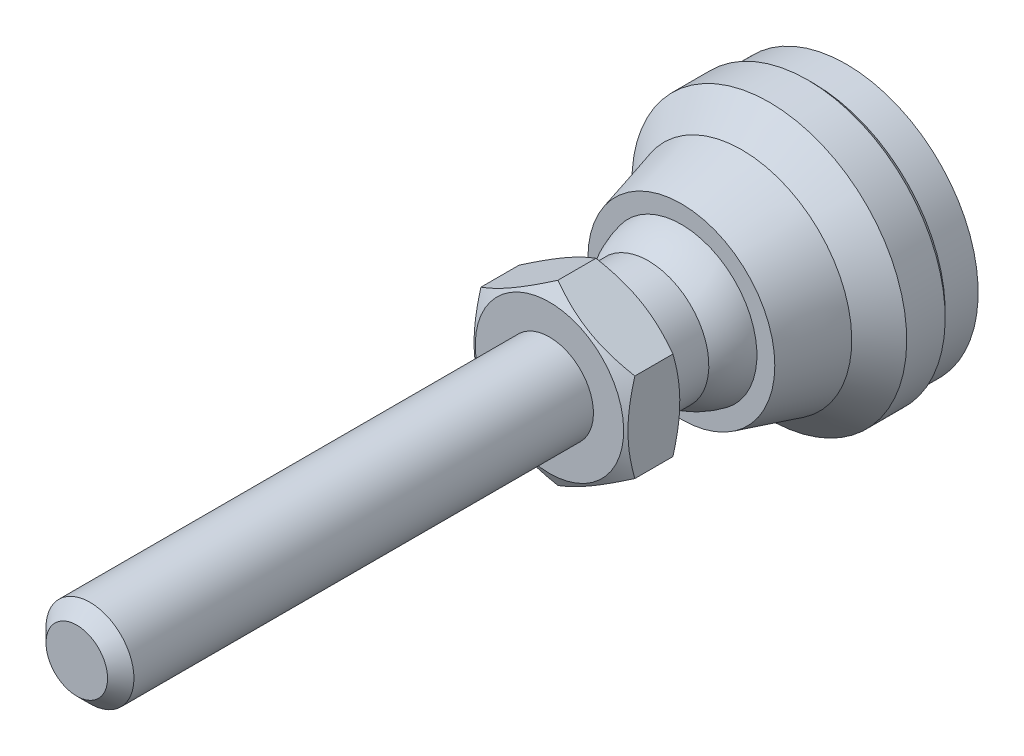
ISO-10303-21;
HEADER;
FILE_DESCRIPTION(('STEP AP214'),'2;1');
FILE_NAME('part.step','',(''),(''),'','','');
FILE_SCHEMA(('AUTOMOTIVE_DESIGN { 1 0 10303 214 1 1 1 1 }'));
ENDSEC;
DATA;
#1=APPLICATION_CONTEXT('core data for automotive mechanical design processes');
#2=APPLICATION_PROTOCOL_DEFINITION('international standard','automotive_design',2000,#1);
#3=PRODUCT_CONTEXT('',#1,'mechanical');
#4=PRODUCT('Part','Part','',(#3));
#5=PRODUCT_RELATED_PRODUCT_CATEGORY('part','',(#4));
#6=PRODUCT_DEFINITION_FORMATION('','',#4);
#7=PRODUCT_DEFINITION_CONTEXT('part definition',#1,'design');
#8=PRODUCT_DEFINITION('design','',#6,#7);
#9=PRODUCT_DEFINITION_SHAPE('','',#8);
#10=(LENGTH_UNIT() NAMED_UNIT(*) SI_UNIT(.MILLI.,.METRE.));
#11=(NAMED_UNIT(*) PLANE_ANGLE_UNIT() SI_UNIT($,.RADIAN.));
#12=(NAMED_UNIT(*) SI_UNIT($,.STERADIAN.) SOLID_ANGLE_UNIT());
#13=UNCERTAINTY_MEASURE_WITH_UNIT(LENGTH_MEASURE(1.E-05),#10,'distance_accuracy_value','');
#14=(GEOMETRIC_REPRESENTATION_CONTEXT(3) GLOBAL_UNCERTAINTY_ASSIGNED_CONTEXT((#13)) GLOBAL_UNIT_ASSIGNED_CONTEXT((#10,
#11,#12)) REPRESENTATION_CONTEXT('',''));
#15=CARTESIAN_POINT('',(0.,0.,0.));
#16=DIRECTION('',(0.,0.,1.));
#17=DIRECTION('',(1.,0.,0.));
#18=AXIS2_PLACEMENT_3D('',#15,#16,#17);
#19=CARTESIAN_POINT('',(-12.,0.,0.));
#20=DIRECTION('',(0.,0.,1.));
#21=DIRECTION('',(0.,-1.,0.));
#22=AXIS2_PLACEMENT_3D('',#19,#20,#21);
#23=PLANE('',#22);
#24=CARTESIAN_POINT('',(0.,0.,0.));
#25=DIRECTION('',(0.,0.,-1.));
#26=DIRECTION('',(0.,1.,0.));
#27=AXIS2_PLACEMENT_3D('',#24,#25,#26);
#28=CIRCLE('',#27,12.);
#29=CARTESIAN_POINT('',(0.,12.,0.));
#30=VERTEX_POINT('',#29);
#31=EDGE_CURVE('E95',#30,#30,#28,.T.);
#32=ORIENTED_EDGE('',*,*,#31,.T.);
#33=EDGE_LOOP('',(#32));
#34=FACE_BOUND('',#33,.T.);
#35=ADVANCED_FACE('F14',(#34),#23,.F.);
#36=CARTESIAN_POINT('',(-5.49999999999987,0.,22.));
#37=DIRECTION('',(0.,0.,1.));
#38=DIRECTION('',(0.,-1.,0.));
#39=AXIS2_PLACEMENT_3D('',#36,#37,#38);
#40=PLANE('',#39);
#41=CARTESIAN_POINT('',(0.,0.,22.));
#42=DIRECTION('',(0.,0.,1.));
#43=DIRECTION('',(0.,-1.,0.));
#44=AXIS2_PLACEMENT_3D('',#41,#42,#43);
#45=CIRCLE('',#44,6.75);
#46=CARTESIAN_POINT('',(0.,-6.75,22.));
#47=VERTEX_POINT('',#46);
#48=EDGE_CURVE('E454',#47,#47,#45,.T.);
#49=ORIENTED_EDGE('',*,*,#48,.F.);
#50=EDGE_LOOP('',(#49));
#51=FACE_BOUND('',#50,.T.);
#52=CARTESIAN_POINT('',(0.,0.,22.));
#53=DIRECTION('',(0.,0.,-1.));
#54=DIRECTION('',(0.,1.,0.));
#55=AXIS2_PLACEMENT_3D('',#52,#53,#54);
#56=CIRCLE('',#55,5.49999999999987);
#57=CARTESIAN_POINT('',(0.,5.49999999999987,22.));
#58=VERTEX_POINT('',#57);
#59=EDGE_CURVE('E119',#58,#58,#56,.T.);
#60=ORIENTED_EDGE('',*,*,#59,.F.);
#61=EDGE_LOOP('',(#60));
#62=FACE_BOUND('',#61,.T.);
#63=ADVANCED_FACE('F145',(#51,#62),#40,.F.);
#64=CARTESIAN_POINT('',(0.,0.,0.));
#65=DIRECTION('',(0.,0.,-1.));
#66=DIRECTION('',(0.,1.,0.));
#67=AXIS2_PLACEMENT_3D('',#64,#65,#66);
#68=CYLINDRICAL_SURFACE('',#67,5.49999999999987);
#69=CARTESIAN_POINT('',(0.,0.,18.));
#70=DIRECTION('',(0.,0.,-1.));
#71=DIRECTION('',(0.,1.,0.));
#72=AXIS2_PLACEMENT_3D('',#69,#70,#71);
#73=CIRCLE('',#72,5.49999999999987);
#74=CARTESIAN_POINT('',(-5.49999999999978,0.,18.));
#75=VERTEX_POINT('',#74);
#76=EDGE_CURVE('E116',#75,#75,#73,.T.);
#77=ORIENTED_EDGE('',*,*,#76,.F.);
#78=EDGE_LOOP('',(#77));
#79=FACE_BOUND('',#78,.T.);
#80=ORIENTED_EDGE('',*,*,#59,.T.);
#81=EDGE_LOOP('',(#80));
#82=FACE_BOUND('',#81,.T.);
#83=ADVANCED_FACE('F151',(#79,#82),#68,.T.);
#84=CARTESIAN_POINT('',(1.38777878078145E-13,0.,13.6698729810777));
#85=DIRECTION('',(0.,0.,-1.));
#86=DIRECTION('',(-1.,0.,0.));
#87=AXIS2_PLACEMENT_3D('',#84,#85,#86);
#88=SPHERICAL_SURFACE('',#87,7.);
#89=CARTESIAN_POINT('',(0.,0.,15.));
#90=DIRECTION('',(0.,0.,-1.));
#91=DIRECTION('',(0.,1.,0.));
#92=AXIS2_PLACEMENT_3D('',#89,#90,#91);
#93=CIRCLE('',#92,6.87246404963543);
#94=CARTESIAN_POINT('',(-6.8724640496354,0.,15.));
#95=VERTEX_POINT('',#94);
#96=EDGE_CURVE('E113',#95,#95,#93,.T.);
#97=CARTESIAN_POINT('',(-6.8724640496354,0.,15.));
#98=CARTESIAN_POINT('',(-6.86587210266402,0.,15.0340591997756));
#99=CARTESIAN_POINT('',(-6.85902692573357,0.,15.0680693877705));
#100=CARTESIAN_POINT('',(-6.84483171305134,0.,15.1359842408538));
#101=CARTESIAN_POINT('',(-6.83748167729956,0.,15.1698889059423));
#102=CARTESIAN_POINT('',(-6.82227834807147,0.,15.2375852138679));
#103=CARTESIAN_POINT('',(-6.81442505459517,0.,15.2713768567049));
#104=CARTESIAN_POINT('',(-6.79821695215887,0.,15.3388396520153));
#105=CARTESIAN_POINT('',(-6.78986214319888,0.,15.3725108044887));
#106=CARTESIAN_POINT('',(-6.77265285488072,0.,15.4397251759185));
#107=CARTESIAN_POINT('',(-6.76379837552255,0.,15.473268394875));
#108=CARTESIAN_POINT('',(-6.74559170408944,0.,15.5402194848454));
#109=CARTESIAN_POINT('',(-6.7362395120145,0.,15.5736273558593));
#110=CARTESIAN_POINT('',(-6.71703948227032,0.,15.6403003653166));
#111=CARTESIAN_POINT('',(-6.70719164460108,0.,15.67356550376));
#112=CARTESIAN_POINT('',(-6.68700250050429,0.,15.7399456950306));
#113=CARTESIAN_POINT('',(-6.67666119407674,0.,15.7730607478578));
#114=CARTESIAN_POINT('',(-6.65548739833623,0.,15.8391334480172));
#115=CARTESIAN_POINT('',(-6.64465490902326,0.,15.8720910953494));
#116=CARTESIAN_POINT('',(-6.62250114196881,0.,15.9378416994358));
#117=CARTESIAN_POINT('',(-6.61117986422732,0.,15.9706346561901));
#118=CARTESIAN_POINT('',(-6.5880510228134,0.,16.0360486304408));
#119=CARTESIAN_POINT('',(-6.57624345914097,0.,16.0686696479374));
#120=CARTESIAN_POINT('',(-6.55214465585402,0.,16.1337325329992));
#121=CARTESIAN_POINT('',(-6.53985341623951,0.,16.1661744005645));
#122=CARTESIAN_POINT('',(-6.5147899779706,0.,16.2308718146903));
#123=CARTESIAN_POINT('',(-6.5020177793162,0.,16.2631273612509));
#124=CARTESIAN_POINT('',(-6.47599524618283,0.,16.3274450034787));
#125=CARTESIAN_POINT('',(-6.46274491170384,0.,16.3595070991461));
#126=CARTESIAN_POINT('',(-6.4357690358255,0.,16.4234307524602));
#127=CARTESIAN_POINT('',(-6.42204349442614,0.,16.455292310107));
#128=CARTESIAN_POINT('',(-6.39412023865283,0.,16.5188078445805));
#129=CARTESIAN_POINT('',(-6.37992252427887,0.,16.5504618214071));
#130=CARTESIAN_POINT('',(-6.35105806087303,0.,16.6135551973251));
#131=CARTESIAN_POINT('',(-6.33639131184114,0.,16.6449945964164));
#132=CARTESIAN_POINT('',(-6.30659202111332,0.,16.7076518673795));
#133=CARTESIAN_POINT('',(-6.29145947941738,0.,16.7388697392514));
#134=CARTESIAN_POINT('',(-6.26073194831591,0.,16.8010770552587));
#135=CARTESIAN_POINT('',(-6.24513695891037,0.,16.8320664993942));
#136=CARTESIAN_POINT('',(-6.21348797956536,0.,16.8938101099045));
#137=CARTESIAN_POINT('',(-6.19743398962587,0.,16.9245642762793));
#138=CARTESIAN_POINT('',(-6.16487055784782,0.,16.9858305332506));
#139=CARTESIAN_POINT('',(-6.14836111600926,0.,17.016342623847));
#140=CARTESIAN_POINT('',(-6.11489042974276,0.,17.0771179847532));
#141=CARTESIAN_POINT('',(-6.09792918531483,0.,17.107381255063));
#142=CARTESIAN_POINT('',(-6.06355864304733,0.,17.1676522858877));
#143=CARTESIAN_POINT('',(-6.04614934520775,0.,17.1976600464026));
#144=CARTESIAN_POINT('',(-6.01088654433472,0.,17.2574134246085));
#145=CARTESIAN_POINT('',(-5.99303304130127,0.,17.2871590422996));
#146=CARTESIAN_POINT('',(-5.95688577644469,0.,17.3463815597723));
#147=CARTESIAN_POINT('',(-5.93859201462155,0.,17.3758584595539));
#148=CARTESIAN_POINT('',(-5.90156827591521,0.,17.4345370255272));
#149=CARTESIAN_POINT('',(-5.88283829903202,0.,17.4637386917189));
#150=CARTESIAN_POINT('',(-5.8449462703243,0.,17.5218603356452));
#151=CARTESIAN_POINT('',(-5.82578421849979,0.,17.5507803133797));
#152=CARTESIAN_POINT('',(-5.7870322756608,0.,17.6083321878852));
#153=CARTESIAN_POINT('',(-5.76744238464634,0.,17.6369640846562));
#154=CARTESIAN_POINT('',(-5.72783909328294,0.,17.6939334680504));
#155=CARTESIAN_POINT('',(-5.707825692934,0.,17.7222709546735));
#156=CARTESIAN_POINT('',(-5.66737980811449,0.,17.778645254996));
#157=CARTESIAN_POINT('',(-5.64694732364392,0.,17.8066820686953));
#158=CARTESIAN_POINT('',(-5.60566778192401,0.,17.862448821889));
#159=CARTESIAN_POINT('',(-5.58482072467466,0.,17.8901787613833));
#160=CARTESIAN_POINT('',(-5.54271666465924,0.,17.9453256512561));
#161=CARTESIAN_POINT('',(-5.52145966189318,0.,17.9727426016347));
#162=CARTESIAN_POINT('',(-5.49999999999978,0.,18.));
#163=B_SPLINE_CURVE_WITH_KNOTS('',3,(#97,#98,#99,#100,#101,#102,#103,#104,#105,#106,#107,#108,
#109,#110,#111,#112,#113,#114,#115,#116,#117,#118,#119,#120,#121,#122,#123,#124,#125,#126,#127,
#128,#129,#130,#131,#132,#133,#134,#135,#136,#137,#138,#139,#140,#141,#142,#143,#144,#145,#146,
#147,#148,#149,#150,#151,#152,#153,#154,#155,#156,#157,#158,#159,#160,#161,#162),.UNSPECIFIED.,
.F.,.F.,(4,2,2,2,2,2,2,2,2,2,2,2,2,2,2,2,2,2,2,2,2,2,2,2,2,2,2,2,2,2,2,2,4),(0.,
0.104072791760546,0.208145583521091,0.312218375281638,0.416291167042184,0.52036395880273,
0.624436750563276,0.728509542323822,0.832582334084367,0.936655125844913,1.04072791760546,
1.144800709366,1.24887350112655,1.3529462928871,1.45701908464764,1.56109187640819,
1.66516466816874,1.76923745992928,1.87331025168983,1.97738304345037,2.08145583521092,
2.18552862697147,2.28960141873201,2.39367421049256,2.4977470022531,2.60181979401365,
2.7058925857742,2.80996537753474,2.91403816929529,3.01811096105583,3.12218375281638,
3.22625654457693,3.33032933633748),.UNSPECIFIED.);
#164=EDGE_CURVE('BSEAM188',#95,#75,#163,.T.);
#165=ORIENTED_EDGE('',*,*,#96,.F.);
#166=ORIENTED_EDGE('',*,*,#76,.T.);
#167=ORIENTED_EDGE('',*,*,#164,.T.);
#168=ORIENTED_EDGE('',*,*,#164,.F.);
#169=EDGE_LOOP('',(#165,#167,#166,#168));
#170=FACE_BOUND('',#169,.T.);
#171=ADVANCED_FACE('F188',(#170),#88,.T.);
#172=CARTESIAN_POINT('',(-8.5,0.,15.));
#173=DIRECTION('',(0.,0.,-1.));
#174=DIRECTION('',(0.,1.,0.));
#175=AXIS2_PLACEMENT_3D('',#172,#173,#174);
#176=PLANE('',#175);
#177=CARTESIAN_POINT('',(0.,0.,15.));
#178=DIRECTION('',(0.,0.,-1.));
#179=DIRECTION('',(0.,1.,0.));
#180=AXIS2_PLACEMENT_3D('',#177,#178,#179);
#181=CIRCLE('',#180,8.5);
#182=CARTESIAN_POINT('',(0.,8.5,15.));
#183=VERTEX_POINT('',#182);
#184=EDGE_CURVE('E110',#183,#183,#181,.T.);
#185=ORIENTED_EDGE('',*,*,#184,.F.);
#186=EDGE_LOOP('',(#185));
#187=FACE_BOUND('',#186,.T.);
#188=ORIENTED_EDGE('',*,*,#96,.T.);
#189=EDGE_LOOP('',(#188));
#190=FACE_BOUND('',#189,.T.);
#191=ADVANCED_FACE('F182',(#187,#190),#176,.F.);
#192=CARTESIAN_POINT('',(0.,0.,15.));
#193=DIRECTION('',(0.,0.,-1.));
#194=DIRECTION('',(0.,1.,0.));
#195=AXIS2_PLACEMENT_3D('',#192,#193,#194);
#196=CONICAL_SURFACE('',#195,8.5,0.266252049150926);
#197=CARTESIAN_POINT('',(0.,0.,9.5));
#198=DIRECTION('',(0.,0.,-1.));
#199=DIRECTION('',(0.,1.,0.));
#200=AXIS2_PLACEMENT_3D('',#197,#198,#199);
#201=CIRCLE('',#200,10.);
#202=CARTESIAN_POINT('',(0.,10.,9.5));
#203=VERTEX_POINT('',#202);
#204=EDGE_CURVE('E107',#203,#203,#201,.T.);
#205=ORIENTED_EDGE('',*,*,#204,.F.);
#206=EDGE_LOOP('',(#205));
#207=FACE_BOUND('',#206,.T.);
#208=ORIENTED_EDGE('',*,*,#184,.T.);
#209=EDGE_LOOP('',(#208));
#210=FACE_BOUND('',#209,.T.);
#211=ADVANCED_FACE('F176',(#207,#210),#196,.T.);
#212=CARTESIAN_POINT('',(0.,0.,9.5));
#213=DIRECTION('',(0.,0.,-1.));
#214=DIRECTION('',(0.,1.,0.));
#215=AXIS2_PLACEMENT_3D('',#212,#213,#214);
#216=CONICAL_SURFACE('',#215,10.,0.785398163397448);
#217=CARTESIAN_POINT('',(0.,0.,6.99999999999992));
#218=DIRECTION('',(0.,0.,-1.));
#219=DIRECTION('',(0.,1.,0.));
#220=AXIS2_PLACEMENT_3D('',#217,#218,#219);
#221=CIRCLE('',#220,12.5);
#222=CARTESIAN_POINT('',(0.,12.5,6.99999999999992));
#223=VERTEX_POINT('',#222);
#224=EDGE_CURVE('E104',#223,#223,#221,.T.);
#225=ORIENTED_EDGE('',*,*,#224,.F.);
#226=EDGE_LOOP('',(#225));
#227=FACE_BOUND('',#226,.T.);
#228=ORIENTED_EDGE('',*,*,#204,.T.);
#229=EDGE_LOOP('',(#228));
#230=FACE_BOUND('',#229,.T.);
#231=ADVANCED_FACE('F170',(#227,#230),#216,.T.);
#232=CARTESIAN_POINT('',(0.,0.,0.));
#233=DIRECTION('',(0.,0.,-1.));
#234=DIRECTION('',(0.,1.,0.));
#235=AXIS2_PLACEMENT_3D('',#232,#233,#234);
#236=CYLINDRICAL_SURFACE('',#235,12.5);
#237=CARTESIAN_POINT('',(0.,0.,3.49999999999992));
#238=DIRECTION('',(0.,0.,-1.));
#239=DIRECTION('',(0.,1.,0.));
#240=AXIS2_PLACEMENT_3D('',#237,#238,#239);
#241=CIRCLE('',#240,12.5);
#242=CARTESIAN_POINT('',(0.,12.5,3.49999999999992));
#243=VERTEX_POINT('',#242);
#244=EDGE_CURVE('E101',#243,#243,#241,.T.);
#245=ORIENTED_EDGE('',*,*,#244,.F.);
#246=EDGE_LOOP('',(#245));
#247=FACE_BOUND('',#246,.T.);
#248=ORIENTED_EDGE('',*,*,#224,.T.);
#249=EDGE_LOOP('',(#248));
#250=FACE_BOUND('',#249,.T.);
#251=ADVANCED_FACE('F164',(#247,#250),#236,.T.);
#252=CARTESIAN_POINT('',(0.,0.,3.49999999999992));
#253=DIRECTION('',(0.,0.,1.));
#254=DIRECTION('',(0.,-1.,0.));
#255=AXIS2_PLACEMENT_3D('',#252,#253,#254);
#256=CONICAL_SURFACE('',#255,12.5,0.785398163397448);
#257=CARTESIAN_POINT('',(0.,0.,2.99999999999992));
#258=DIRECTION('',(0.,0.,-1.));
#259=DIRECTION('',(0.,1.,0.));
#260=AXIS2_PLACEMENT_3D('',#257,#258,#259);
#261=CIRCLE('',#260,12.);
#262=CARTESIAN_POINT('',(0.,12.,2.99999999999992));
#263=VERTEX_POINT('',#262);
#264=EDGE_CURVE('E98',#263,#263,#261,.T.);
#265=ORIENTED_EDGE('',*,*,#264,.F.);
#266=EDGE_LOOP('',(#265));
#267=FACE_BOUND('',#266,.T.);
#268=ORIENTED_EDGE('',*,*,#244,.T.);
#269=EDGE_LOOP('',(#268));
#270=FACE_BOUND('',#269,.T.);
#271=ADVANCED_FACE('F158',(#267,#270),#256,.T.);
#272=CARTESIAN_POINT('',(0.,0.,0.));
#273=DIRECTION('',(0.,0.,-1.));
#274=DIRECTION('',(0.,1.,0.));
#275=AXIS2_PLACEMENT_3D('',#272,#273,#274);
#276=CYLINDRICAL_SURFACE('',#275,12.);
#277=ORIENTED_EDGE('',*,*,#31,.F.);
#278=EDGE_LOOP('',(#277));
#279=FACE_BOUND('',#278,.T.);
#280=ORIENTED_EDGE('',*,*,#264,.T.);
#281=EDGE_LOOP('',(#280));
#282=FACE_BOUND('',#281,.T.);
#283=ADVANCED_FACE('F143',(#279,#282),#276,.T.);
#284=CARTESIAN_POINT('',(0.,0.,22.));
#285=DIRECTION('',(0.,0.,1.));
#286=DIRECTION('',(0.,-1.,0.));
#287=AXIS2_PLACEMENT_3D('',#284,#285,#286);
#288=CONICAL_SURFACE('',#287,6.75,1.0471975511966);
#289=CARTESIAN_POINT('',(0.000200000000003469,-8.0830192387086,22.7696190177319));
#290=CARTESIAN_POINT('',(-0.15366790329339,-7.99418356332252,22.7183374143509));
#291=CARTESIAN_POINT('',(-0.308109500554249,-7.90501666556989,22.669383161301));
#292=CARTESIAN_POINT('',(-0.618246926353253,-7.72595873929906,22.5767703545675));
#293=CARTESIAN_POINT('',(-0.773943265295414,-7.63606741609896,22.5331140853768));
#294=CARTESIAN_POINT('',(-1.24352516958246,-7.36495417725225,22.4109491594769));
#295=CARTESIAN_POINT('',(-1.5592643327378,-7.18266208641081,22.3414631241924));
#296=CARTESIAN_POINT('',(-2.03176224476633,-6.90986528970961,22.2599825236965));
#297=CARTESIAN_POINT('',(-2.18710922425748,-6.82017566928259,22.2367710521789));
#298=CARTESIAN_POINT('',(-2.49850511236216,-6.64039116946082,22.1978487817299));
#299=CARTESIAN_POINT('',(-2.65455395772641,-6.55029632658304,22.1821373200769));
#300=CARTESIAN_POINT('',(-2.96692267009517,-6.36995016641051,22.1586154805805));
#301=CARTESIAN_POINT('',(-3.12324202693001,-6.27969914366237,22.1507961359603));
#302=CARTESIAN_POINT('',(-3.43601650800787,-6.09911871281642,22.1432178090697));
#303=CARTESIAN_POINT('',(-3.59247162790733,-6.00878930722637,22.1434585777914));
#304=CARTESIAN_POINT('',(-4.02110687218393,-5.76131663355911,22.155197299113));
#305=CARTESIAN_POINT('',(-4.29314668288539,-5.60425437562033,22.1749033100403));
#306=CARTESIAN_POINT('',(-4.83541944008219,-5.29117305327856,22.2373910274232));
#307=CARTESIAN_POINT('',(-5.10565047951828,-5.13515508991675,22.2801940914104));
#308=CARTESIAN_POINT('',(-5.64901454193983,-4.82144370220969,22.3871892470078));
#309=CARTESIAN_POINT('',(-5.92207900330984,-4.6637898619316,22.4518346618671));
#310=CARTESIAN_POINT('',(-6.46413578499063,-4.35083323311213,22.5985536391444));
#311=CARTESIAN_POINT('',(-6.73313504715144,-4.19552643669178,22.680592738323));
#312=CARTESIAN_POINT('',(-7.0002,-4.04133641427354,22.7696190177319));
#313=B_SPLINE_CURVE_WITH_KNOTS('',3,(#289,#290,#291,#292,#293,#294,#295,#296,#297,#298,#299,
#300,#301,#302,#303,#304,#305,#306,#307,#308,#309,#310,#311,#312),.UNSPECIFIED.,.F.,.F.,(4,2,2,
2,2,2,2,2,2,2,2,4),(0.,0.554727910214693,1.10969417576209,2.2219327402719,2.76443041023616,
3.30688013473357,3.84871284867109,4.39052882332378,5.33376515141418,6.27787517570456,
7.2429241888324,8.20607866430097),.UNSPECIFIED.);
#314=CARTESIAN_POINT('',(0.,-8.08290376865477,22.7695523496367));
#315=VERTEX_POINT('',#314);
#316=CARTESIAN_POINT('',(-7.,-4.04145188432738,22.7695523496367));
#317=VERTEX_POINT('',#316);
#318=EDGE_CURVE('E72',#315,#317,#313,.T.);
#319=ORIENTED_EDGE('',*,*,#318,.T.);
#320=CARTESIAN_POINT('',(-7.,10.8484748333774,25.556954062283));
#321=CARTESIAN_POINT('',(-7.,10.5427997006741,25.4087038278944));
#322=CARTESIAN_POINT('',(-7.,10.2364220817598,25.2618772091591));
#323=CARTESIAN_POINT('',(-7.,9.62188824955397,24.9718720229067));
#324=CARTESIAN_POINT('',(-7.,9.31373176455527,24.8286940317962));
#325=CARTESIAN_POINT('',(-7.,8.69367535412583,24.5460650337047));
#326=CARTESIAN_POINT('',(-7.,8.38176417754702,24.4066386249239));
#327=CARTESIAN_POINT('',(-7.,7.75545845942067,24.1335014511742));
#328=CARTESIAN_POINT('',(-7.,7.44106403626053,23.9997904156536));
#329=CARTESIAN_POINT('',(-7.,6.79917329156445,23.7354259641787));
#330=CARTESIAN_POINT('',(-7.,6.47157970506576,23.6050074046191));
#331=CARTESIAN_POINT('',(-7.,5.81255799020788,23.3540586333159));
#332=CARTESIAN_POINT('',(-7.,5.48112943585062,23.2335295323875));
#333=CARTESIAN_POINT('',(-7.,4.81452919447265,23.0055295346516));
#334=CARTESIAN_POINT('',(-7.,4.47936666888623,22.898032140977));
#335=CARTESIAN_POINT('',(-7.,3.80424596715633,22.699548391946));
#336=CARTESIAN_POINT('',(-7.,3.46428934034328,22.608556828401));
#337=CARTESIAN_POINT('',(-7.,2.7812157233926,22.4479457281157));
#338=CARTESIAN_POINT('',(-7.,2.43812666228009,22.3782106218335));
#339=CARTESIAN_POINT('',(-7.,1.9203746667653,22.2925731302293));
#340=CARTESIAN_POINT('',(-7.,1.747258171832,22.2671869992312));
#341=CARTESIAN_POINT('',(-7.,1.40016720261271,22.2232345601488));
#342=CARTESIAN_POINT('',(-7.,1.22619281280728,22.2046675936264));
#343=CARTESIAN_POINT('',(-7.,0.879888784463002,22.1749558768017));
#344=CARTESIAN_POINT('',(-7.,0.707567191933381,22.1637177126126));
#345=CARTESIAN_POINT('',(-7.,0.362603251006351,22.1485379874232));
#346=CARTESIAN_POINT('',(-7.,0.189960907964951,22.1445963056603));
#347=CARTESIAN_POINT('',(-7.,-0.155336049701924,22.1441035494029));
#348=CARTESIAN_POINT('',(-7.,-0.327990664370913,22.1475525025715));
#349=CARTESIAN_POINT('',(-7.,-0.673001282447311,22.1617568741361));
#350=CARTESIAN_POINT('',(-7.,-0.845357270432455,22.1725126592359));
#351=CARTESIAN_POINT('',(-7.,-1.25980161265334,22.2069336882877));
#352=CARTESIAN_POINT('',(-7.,-1.50160708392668,22.2340780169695));
#353=CARTESIAN_POINT('',(-7.,-1.98340716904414,22.3012656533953));
#354=CARTESIAN_POINT('',(-7.,-2.22340153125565,22.341310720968));
#355=CARTESIAN_POINT('',(-7.,-2.94040253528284,22.4786722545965));
#356=CARTESIAN_POINT('',(-7.,-3.41415655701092,22.593189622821));
#357=CARTESIAN_POINT('',(-7.,-4.12253842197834,22.7915736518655));
#358=CARTESIAN_POINT('',(-7.,-4.3608455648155,22.8630562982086));
#359=CARTESIAN_POINT('',(-7.,-4.83514487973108,23.0133965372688));
#360=CARTESIAN_POINT('',(-7.,-5.07113703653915,23.0922541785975));
#361=CARTESIAN_POINT('',(-7.,-5.54088159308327,23.256083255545));
#362=CARTESIAN_POINT('',(-7.,-5.77463471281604,23.3410526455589));
#363=CARTESIAN_POINT('',(-7.,-6.24020751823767,23.5161103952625));
#364=CARTESIAN_POINT('',(-7.,-6.47202722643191,23.6061986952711));
#365=CARTESIAN_POINT('',(-7.,-7.01856915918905,23.8244322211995));
#366=CARTESIAN_POINT('',(-7.,-7.3325506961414,23.9544289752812));
#367=CARTESIAN_POINT('',(-7.,-7.95784989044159,24.2206970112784));
#368=CARTESIAN_POINT('',(-7.,-8.26916738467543,24.3569686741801));
#369=CARTESIAN_POINT('',(-7.,-8.88962804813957,24.6345272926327));
#370=CARTESIAN_POINT('',(-7.,-9.19877076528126,24.7758152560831));
#371=CARTESIAN_POINT('',(-7.,-9.81519417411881,25.062403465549));
#372=CARTESIAN_POINT('',(-7.,-10.1224748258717,25.2077037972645));
#373=CARTESIAN_POINT('',(-7.,-10.7357998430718,25.5017179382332));
#374=CARTESIAN_POINT('',(-7.,-11.0418425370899,25.6504352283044));
#375=CARTESIAN_POINT('',(-7.,-11.6526102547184,25.9505538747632));
#376=CARTESIAN_POINT('',(-7.,-11.9573352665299,26.1019552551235));
#377=CARTESIAN_POINT('',(-7.,-12.8697674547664,26.5594316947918));
#378=CARTESIAN_POINT('',(-7.,-13.4758138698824,26.8688187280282));
#379=CARTESIAN_POINT('',(-7.,-14.6340274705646,27.4676135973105));
#380=CARTESIAN_POINT('',(-7.,-15.1864535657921,27.7565228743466));
#381=CARTESIAN_POINT('',(-7.,-16.2892539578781,28.3382753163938));
#382=CARTESIAN_POINT('',(-7.,-16.839628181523,28.6311186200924));
#383=CARTESIAN_POINT('',(-7.,-17.9374076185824,29.2190686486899));
#384=CARTESIAN_POINT('',(-7.,-18.4848168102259,29.5141679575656));
#385=CARTESIAN_POINT('',(-7.,-19.5783231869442,30.106716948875));
#386=CARTESIAN_POINT('',(-7.,-20.1244204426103,30.4041665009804));
#387=CARTESIAN_POINT('',(-7.,-20.6700347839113,30.7024933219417));
#388=B_SPLINE_CURVE_WITH_KNOTS('',3,(#320,#321,#322,#323,#324,#325,#326,#327,#328,#329,#330,
#331,#332,#333,#334,#335,#336,#337,#338,#339,#340,#341,#342,#343,#344,#345,#346,#347,#348,#349,
#350,#351,#352,#353,#354,#355,#356,#357,#358,#359,#360,#361,#362,#363,#364,#365,#366,#367,#368,
#369,#370,#371,#372,#373,#374,#375,#376,#377,#378,#379,#380,#381,#382,#383,#384,#385,#386,#387),
.UNSPECIFIED.,.F.,.F.,(4,2,2,2,2,2,2,2,2,2,2,2,2,2,2,2,2,2,2,2,2,2,2,2,2,2,2,2,2,2,2,2,2,4),(0.,
1.01919782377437,2.03855567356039,3.06347545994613,4.08834667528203,5.14602192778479,
6.20381581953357,7.25942152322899,8.31469356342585,9.36412140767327,9.88891202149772,
10.4136519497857,10.9315655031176,11.4494704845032,11.9673774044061,12.4853103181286,
13.21487071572,13.9445306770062,15.4046621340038,16.1509921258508,16.8973270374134,
17.6434133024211,18.3894908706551,19.408885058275,20.4283412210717,21.4480033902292,
22.4676873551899,23.4884606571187,24.5092430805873,26.5505344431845,28.4207550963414,
30.2910418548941,32.156689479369,34.0222343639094),.UNSPECIFIED.);
#389=CARTESIAN_POINT('',(-7.,4.04145188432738,22.7695523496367));
#390=VERTEX_POINT('',#389);
#391=EDGE_CURVE('E80',#317,#390,#388,.F.);
#392=ORIENTED_EDGE('',*,*,#391,.T.);
#393=CARTESIAN_POINT('',(-7.0002,4.04133641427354,22.7696190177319));
#394=CARTESIAN_POINT('',(-6.84633209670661,4.13017208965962,22.7183374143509));
#395=CARTESIAN_POINT('',(-6.69189049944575,4.21933898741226,22.669383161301));
#396=CARTESIAN_POINT('',(-6.38175307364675,4.39839691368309,22.5767703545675));
#397=CARTESIAN_POINT('',(-6.22605673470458,4.48828823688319,22.5331140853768));
#398=CARTESIAN_POINT('',(-5.75647483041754,4.75940147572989,22.4109491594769));
#399=CARTESIAN_POINT('',(-5.4407356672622,4.94169356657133,22.3414631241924));
#400=CARTESIAN_POINT('',(-4.96823775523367,5.21449036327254,22.2599825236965));
#401=CARTESIAN_POINT('',(-4.81289077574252,5.30417998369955,22.2367710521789));
#402=CARTESIAN_POINT('',(-4.50149488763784,5.48396448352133,22.1978487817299));
#403=CARTESIAN_POINT('',(-4.34544604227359,5.57405932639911,22.1821373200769));
#404=CARTESIAN_POINT('',(-4.03307732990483,5.75440548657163,22.1586154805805));
#405=CARTESIAN_POINT('',(-3.87675797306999,5.84465650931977,22.1507961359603));
#406=CARTESIAN_POINT('',(-3.56398349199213,6.02523694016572,22.1432178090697));
#407=CARTESIAN_POINT('',(-3.40752837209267,6.11556634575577,22.1434585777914));
#408=CARTESIAN_POINT('',(-2.97889312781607,6.36303901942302,22.155197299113));
#409=CARTESIAN_POINT('',(-2.7068533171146,6.52010127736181,22.1749033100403));
#410=CARTESIAN_POINT('',(-2.16458055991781,6.83318259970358,22.2373910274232));
#411=CARTESIAN_POINT('',(-1.89434952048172,6.9892005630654,22.2801940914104));
#412=CARTESIAN_POINT('',(-1.35098545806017,7.30291195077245,22.3871892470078));
#413=CARTESIAN_POINT('',(-1.07792099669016,7.46056579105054,22.4518346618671));
#414=CARTESIAN_POINT('',(-0.535864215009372,7.77352241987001,22.5985536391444));
#415=CARTESIAN_POINT('',(-0.266864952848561,7.92882921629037,22.680592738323));
#416=CARTESIAN_POINT('',(0.000199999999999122,8.0830192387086,22.7696190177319));
#417=B_SPLINE_CURVE_WITH_KNOTS('',3,(#393,#394,#395,#396,#397,#398,#399,#400,#401,#402,#403,
#404,#405,#406,#407,#408,#409,#410,#411,#412,#413,#414,#415,#416),.UNSPECIFIED.,.F.,.F.,(4,2,2,
2,2,2,2,2,2,2,2,4),(0.,0.554727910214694,1.10969417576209,2.2219327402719,2.76443041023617,
3.30688013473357,3.84871284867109,4.39052882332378,5.33376515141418,6.27787517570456,
7.2429241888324,8.20607866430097),.UNSPECIFIED.);
#418=CARTESIAN_POINT('',(0.,8.08290376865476,22.7695523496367));
#419=VERTEX_POINT('',#418);
#420=EDGE_CURVE('E409',#390,#419,#417,.T.);
#421=ORIENTED_EDGE('',*,*,#420,.T.);
#422=CARTESIAN_POINT('',(-0.000200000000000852,8.0830192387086,22.7696190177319));
#423=CARTESIAN_POINT('',(0.15366790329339,7.99418356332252,22.7183374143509));
#424=CARTESIAN_POINT('',(0.308109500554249,7.90501666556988,22.669383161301));
#425=CARTESIAN_POINT('',(0.618246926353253,7.72595873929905,22.5767703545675));
#426=CARTESIAN_POINT('',(0.773943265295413,7.63606741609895,22.5331140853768));
#427=CARTESIAN_POINT('',(1.24352516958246,7.36495417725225,22.4109491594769));
#428=CARTESIAN_POINT('',(1.5592643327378,7.18266208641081,22.3414631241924));
#429=CARTESIAN_POINT('',(2.03176224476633,6.9098652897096,22.2599825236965));
#430=CARTESIAN_POINT('',(2.18710922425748,6.82017566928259,22.2367710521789));
#431=CARTESIAN_POINT('',(2.49850511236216,6.64039116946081,22.1978487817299));
#432=CARTESIAN_POINT('',(2.6545539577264,6.55029632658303,22.1821373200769));
#433=CARTESIAN_POINT('',(2.96692267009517,6.36995016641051,22.1586154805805));
#434=CARTESIAN_POINT('',(3.12324202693,6.27969914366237,22.1507961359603));
#435=CARTESIAN_POINT('',(3.43601650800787,6.09911871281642,22.1432178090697));
#436=CARTESIAN_POINT('',(3.59247162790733,6.00878930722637,22.1434585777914));
#437=CARTESIAN_POINT('',(4.02110687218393,5.76131663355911,22.155197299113));
#438=CARTESIAN_POINT('',(4.29314668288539,5.60425437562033,22.1749033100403));
#439=CARTESIAN_POINT('',(4.83541944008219,5.29117305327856,22.2373910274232));
#440=CARTESIAN_POINT('',(5.10565047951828,5.13515508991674,22.2801940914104));
#441=CARTESIAN_POINT('',(5.64901454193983,4.82144370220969,22.3871892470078));
#442=CARTESIAN_POINT('',(5.92207900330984,4.66378986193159,22.4518346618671));
#443=CARTESIAN_POINT('',(6.46413578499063,4.35083323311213,22.5985536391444));
#444=CARTESIAN_POINT('',(6.73313504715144,4.19552643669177,22.680592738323));
#445=CARTESIAN_POINT('',(7.0002,4.04133641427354,22.7696190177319));
#446=B_SPLINE_CURVE_WITH_KNOTS('',3,(#422,#423,#424,#425,#426,#427,#428,#429,#430,#431,#432,
#433,#434,#435,#436,#437,#438,#439,#440,#441,#442,#443,#444,#445),.UNSPECIFIED.,.F.,.F.,(4,2,2,
2,2,2,2,2,2,2,2,4),(0.,0.554727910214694,1.10969417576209,2.2219327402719,2.76443041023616,
3.30688013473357,3.84871284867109,4.39052882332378,5.33376515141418,6.27787517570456,
7.2429241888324,8.20607866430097),.UNSPECIFIED.);
#447=CARTESIAN_POINT('',(7.,4.04145188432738,22.7695523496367));
#448=VERTEX_POINT('',#447);
#449=EDGE_CURVE('E404',#419,#448,#446,.T.);
#450=ORIENTED_EDGE('',*,*,#449,.T.);
#451=CARTESIAN_POINT('',(7.,10.8484748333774,25.556954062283));
#452=CARTESIAN_POINT('',(7.,10.5427997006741,25.4087038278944));
#453=CARTESIAN_POINT('',(7.,10.2364220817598,25.2618772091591));
#454=CARTESIAN_POINT('',(7.,9.62188824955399,24.9718720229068));
#455=CARTESIAN_POINT('',(7.,9.31373176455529,24.8286940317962));
#456=CARTESIAN_POINT('',(7.,8.69367535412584,24.5460650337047));
#457=CARTESIAN_POINT('',(7.,8.38176417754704,24.4066386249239));
#458=CARTESIAN_POINT('',(7.,7.75545845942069,24.1335014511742));
#459=CARTESIAN_POINT('',(7.,7.44106403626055,23.9997904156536));
#460=CARTESIAN_POINT('',(7.,6.79917329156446,23.7354259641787));
#461=CARTESIAN_POINT('',(7.,6.47157970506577,23.6050074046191));
#462=CARTESIAN_POINT('',(7.,5.81255799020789,23.3540586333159));
#463=CARTESIAN_POINT('',(7.,5.48112943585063,23.2335295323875));
#464=CARTESIAN_POINT('',(7.,4.81452919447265,23.0055295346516));
#465=CARTESIAN_POINT('',(7.,4.47936666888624,22.898032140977));
#466=CARTESIAN_POINT('',(7.,3.80424596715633,22.699548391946));
#467=CARTESIAN_POINT('',(7.,3.46428934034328,22.608556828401));
#468=CARTESIAN_POINT('',(7.,2.7812157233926,22.4479457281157));
#469=CARTESIAN_POINT('',(7.,2.43812666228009,22.3782106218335));
#470=CARTESIAN_POINT('',(7.,1.9203746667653,22.2925731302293));
#471=CARTESIAN_POINT('',(7.,1.747258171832,22.2671869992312));
#472=CARTESIAN_POINT('',(7.,1.40016720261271,22.2232345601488));
#473=CARTESIAN_POINT('',(7.,1.22619281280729,22.2046675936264));
#474=CARTESIAN_POINT('',(7.,0.879888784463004,22.1749558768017));
#475=CARTESIAN_POINT('',(7.,0.707567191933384,22.1637177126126));
#476=CARTESIAN_POINT('',(7.,0.362603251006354,22.1485379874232));
#477=CARTESIAN_POINT('',(7.,0.189960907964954,22.1445963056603));
#478=CARTESIAN_POINT('',(7.,-0.155336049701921,22.1441035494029));
#479=CARTESIAN_POINT('',(7.,-0.32799066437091,22.1475525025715));
#480=CARTESIAN_POINT('',(7.,-0.673001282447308,22.1617568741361));
#481=CARTESIAN_POINT('',(7.,-0.845357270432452,22.1725126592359));
#482=CARTESIAN_POINT('',(7.,-1.25980161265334,22.2069336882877));
#483=CARTESIAN_POINT('',(7.,-1.50160708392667,22.2340780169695));
#484=CARTESIAN_POINT('',(7.,-1.98340716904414,22.3012656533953));
#485=CARTESIAN_POINT('',(7.,-2.22340153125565,22.341310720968));
#486=CARTESIAN_POINT('',(7.,-2.94040253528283,22.4786722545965));
#487=CARTESIAN_POINT('',(7.,-3.41415655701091,22.593189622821));
#488=CARTESIAN_POINT('',(7.,-4.12253842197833,22.7915736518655));
#489=CARTESIAN_POINT('',(7.,-4.36084556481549,22.8630562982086));
#490=CARTESIAN_POINT('',(7.,-4.83514487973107,23.0133965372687));
#491=CARTESIAN_POINT('',(7.,-5.07113703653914,23.0922541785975));
#492=CARTESIAN_POINT('',(7.,-5.54088159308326,23.256083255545));
#493=CARTESIAN_POINT('',(7.,-5.77463471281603,23.3410526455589));
#494=CARTESIAN_POINT('',(7.,-6.24020751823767,23.5161103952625));
#495=CARTESIAN_POINT('',(7.,-6.4720272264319,23.6061986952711));
#496=CARTESIAN_POINT('',(7.,-7.01856915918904,23.8244322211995));
#497=CARTESIAN_POINT('',(7.,-7.33255069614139,23.9544289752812));
#498=CARTESIAN_POINT('',(7.,-7.95784989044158,24.2206970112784));
#499=CARTESIAN_POINT('',(7.,-8.26916738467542,24.3569686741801));
#500=CARTESIAN_POINT('',(7.,-8.88962804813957,24.6345272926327));
#501=CARTESIAN_POINT('',(7.,-9.19877076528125,24.7758152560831));
#502=CARTESIAN_POINT('',(7.,-9.8151941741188,25.062403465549));
#503=CARTESIAN_POINT('',(7.,-10.1224748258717,25.2077037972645));
#504=CARTESIAN_POINT('',(7.,-10.7357998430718,25.5017179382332));
#505=CARTESIAN_POINT('',(7.,-11.0418425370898,25.6504352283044));
#506=CARTESIAN_POINT('',(7.,-11.6526102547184,25.9505538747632));
#507=CARTESIAN_POINT('',(7.,-11.9573352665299,26.1019552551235));
#508=CARTESIAN_POINT('',(7.,-12.8697674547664,26.5594316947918));
#509=CARTESIAN_POINT('',(7.,-13.4758138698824,26.8688187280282));
#510=CARTESIAN_POINT('',(7.,-14.6340274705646,27.4676135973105));
#511=CARTESIAN_POINT('',(7.,-15.1864535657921,27.7565228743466));
#512=CARTESIAN_POINT('',(7.,-16.2892539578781,28.3382753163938));
#513=CARTESIAN_POINT('',(7.,-16.839628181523,28.6311186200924));
#514=CARTESIAN_POINT('',(7.,-17.9374076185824,29.2190686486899));
#515=CARTESIAN_POINT('',(7.,-18.4848168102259,29.5141679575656));
#516=CARTESIAN_POINT('',(7.,-19.5783231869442,30.106716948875));
#517=CARTESIAN_POINT('',(7.,-20.1244204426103,30.4041665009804));
#518=CARTESIAN_POINT('',(7.,-20.6700347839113,30.7024933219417));
#519=B_SPLINE_CURVE_WITH_KNOTS('',3,(#451,#452,#453,#454,#455,#456,#457,#458,#459,#460,#461,
#462,#463,#464,#465,#466,#467,#468,#469,#470,#471,#472,#473,#474,#475,#476,#477,#478,#479,#480,
#481,#482,#483,#484,#485,#486,#487,#488,#489,#490,#491,#492,#493,#494,#495,#496,#497,#498,#499,
#500,#501,#502,#503,#504,#505,#506,#507,#508,#509,#510,#511,#512,#513,#514,#515,#516,#517,#518),
.UNSPECIFIED.,.F.,.F.,(4,2,2,2,2,2,2,2,2,2,2,2,2,2,2,2,2,2,2,2,2,2,2,2,2,2,2,2,2,2,2,2,2,4),(0.,
1.01919782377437,2.0385556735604,3.06347545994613,4.08834667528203,5.1460219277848,
6.20381581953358,7.25942152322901,8.31469356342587,9.36412140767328,9.88891202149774,
10.4136519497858,10.9315655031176,11.4494704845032,11.9673774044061,12.4853103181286,
13.21487071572,13.9445306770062,15.4046621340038,16.1509921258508,16.8973270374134,
17.6434133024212,18.3894908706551,19.408885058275,20.4283412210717,21.4480033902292,
22.4676873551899,23.4884606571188,24.5092430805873,26.5505344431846,28.4207550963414,
30.2910418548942,32.156689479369,34.0222343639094),.UNSPECIFIED.);
#520=CARTESIAN_POINT('',(7.,-4.04145188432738,22.7695523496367));
#521=VERTEX_POINT('',#520);
#522=EDGE_CURVE('E33',#448,#521,#519,.T.);
#523=ORIENTED_EDGE('',*,*,#522,.T.);
#524=CARTESIAN_POINT('',(7.0002,-4.04133641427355,22.7696190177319));
#525=CARTESIAN_POINT('',(6.84633209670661,-4.13017208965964,22.7183374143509));
#526=CARTESIAN_POINT('',(6.69189049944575,-4.21933898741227,22.669383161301));
#527=CARTESIAN_POINT('',(6.38175307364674,-4.3983969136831,22.5767703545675));
#528=CARTESIAN_POINT('',(6.22605673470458,-4.4882882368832,22.5331140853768));
#529=CARTESIAN_POINT('',(5.75647483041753,-4.7594014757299,22.4109491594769));
#530=CARTESIAN_POINT('',(5.4407356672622,-4.94169356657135,22.3414631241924));
#531=CARTESIAN_POINT('',(4.96823775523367,-5.21449036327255,22.2599825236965));
#532=CARTESIAN_POINT('',(4.81289077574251,-5.30417998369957,22.2367710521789));
#533=CARTESIAN_POINT('',(4.50149488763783,-5.48396448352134,22.1978487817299));
#534=CARTESIAN_POINT('',(4.34544604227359,-5.57405932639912,22.1821373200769));
#535=CARTESIAN_POINT('',(4.03307732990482,-5.75440548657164,22.1586154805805));
#536=CARTESIAN_POINT('',(3.87675797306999,-5.84465650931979,22.1507961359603));
#537=CARTESIAN_POINT('',(3.56398349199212,-6.02523694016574,22.1432178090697));
#538=CARTESIAN_POINT('',(3.40752837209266,-6.11556634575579,22.1434585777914));
#539=CARTESIAN_POINT('',(2.97889312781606,-6.36303901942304,22.155197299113));
#540=CARTESIAN_POINT('',(2.7068533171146,-6.52010127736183,22.1749033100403));
#541=CARTESIAN_POINT('',(2.1645805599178,-6.8331825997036,22.2373910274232));
#542=CARTESIAN_POINT('',(1.89434952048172,-6.98920056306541,22.2801940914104));
#543=CARTESIAN_POINT('',(1.35098545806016,-7.30291195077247,22.3871892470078));
#544=CARTESIAN_POINT('',(1.07792099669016,-7.46056579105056,22.4518346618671));
#545=CARTESIAN_POINT('',(0.535864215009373,-7.77352241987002,22.5985536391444));
#546=CARTESIAN_POINT('',(0.266864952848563,-7.92882921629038,22.680592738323));
#547=CARTESIAN_POINT('',(-0.000199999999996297,-8.08301923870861,22.7696190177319));
#548=B_SPLINE_CURVE_WITH_KNOTS('',3,(#524,#525,#526,#527,#528,#529,#530,#531,#532,#533,#534,
#535,#536,#537,#538,#539,#540,#541,#542,#543,#544,#545,#546,#547),.UNSPECIFIED.,.F.,.F.,(4,2,2,
2,2,2,2,2,2,2,2,4),(0.,0.554727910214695,1.10969417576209,2.2219327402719,2.76443041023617,
3.30688013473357,3.8487128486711,4.39052882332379,5.33376515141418,6.27787517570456,
7.24292418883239,8.20607866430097),.UNSPECIFIED.);
#549=EDGE_CURVE('E9',#521,#315,#548,.T.);
#550=ORIENTED_EDGE('',*,*,#549,.T.);
#551=EDGE_LOOP('',(#319,#392,#421,#450,#523,#550));
#552=FACE_BOUND('',#551,.T.);
#553=ORIENTED_EDGE('',*,*,#48,.T.);
#554=EDGE_LOOP('',(#553));
#555=FACE_BOUND('',#554,.T.);
#556=ADVANCED_FACE('F70',(#552,#555),#288,.T.);
#557=CARTESIAN_POINT('',(-2.8,0.,70.));
#558=DIRECTION('',(0.,0.,-1.));
#559=DIRECTION('',(0.,1.,0.));
#560=AXIS2_PLACEMENT_3D('',#557,#558,#559);
#561=PLANE('',#560);
#562=CARTESIAN_POINT('',(0.,0.,70.));
#563=DIRECTION('',(0.,0.,-1.));
#564=DIRECTION('',(0.,1.,0.));
#565=AXIS2_PLACEMENT_3D('',#562,#563,#564);
#566=CIRCLE('',#565,2.8);
#567=CARTESIAN_POINT('',(0.,2.8,70.));
#568=VERTEX_POINT('',#567);
#569=EDGE_CURVE('E27',#568,#568,#566,.T.);
#570=ORIENTED_EDGE('',*,*,#569,.F.);
#571=EDGE_LOOP('',(#570));
#572=FACE_BOUND('',#571,.T.);
#573=ADVANCED_FACE('F132',(#572),#561,.F.);
#574=CARTESIAN_POINT('',(0.,0.,70.));
#575=DIRECTION('',(0.,0.,-1.));
#576=DIRECTION('',(0.,1.,0.));
#577=AXIS2_PLACEMENT_3D('',#574,#575,#576);
#578=CONICAL_SURFACE('',#577,2.8,0.785398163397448);
#579=CARTESIAN_POINT('',(0.,0.,68.8));
#580=DIRECTION('',(0.,0.,-1.));
#581=DIRECTION('',(0.,1.,0.));
#582=AXIS2_PLACEMENT_3D('',#579,#580,#581);
#583=CIRCLE('',#582,3.99999999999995);
#584=CARTESIAN_POINT('',(0.,3.99999999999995,68.8));
#585=VERTEX_POINT('',#584);
#586=EDGE_CURVE('E125',#585,#585,#583,.T.);
#587=ORIENTED_EDGE('',*,*,#586,.F.);
#588=EDGE_LOOP('',(#587));
#589=FACE_BOUND('',#588,.T.);
#590=ORIENTED_EDGE('',*,*,#569,.T.);
#591=EDGE_LOOP('',(#590));
#592=FACE_BOUND('',#591,.T.);
#593=ADVANCED_FACE('F130',(#589,#592),#578,.T.);
#594=CARTESIAN_POINT('',(0.,0.,0.));
#595=DIRECTION('',(0.,0.,-1.));
#596=DIRECTION('',(0.,1.,0.));
#597=AXIS2_PLACEMENT_3D('',#594,#595,#596);
#598=CYLINDRICAL_SURFACE('',#597,3.99999999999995);
#599=CARTESIAN_POINT('',(0.,0.,27.));
#600=DIRECTION('',(0.,0.,-1.));
#601=DIRECTION('',(0.,1.,0.));
#602=AXIS2_PLACEMENT_3D('',#599,#600,#601);
#603=CIRCLE('',#602,3.99999999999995);
#604=CARTESIAN_POINT('',(0.,3.99999999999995,27.));
#605=VERTEX_POINT('',#604);
#606=EDGE_CURVE('E122',#605,#605,#603,.T.);
#607=ORIENTED_EDGE('',*,*,#606,.F.);
#608=EDGE_LOOP('',(#607));
#609=FACE_BOUND('',#608,.T.);
#610=ORIENTED_EDGE('',*,*,#586,.T.);
#611=EDGE_LOOP('',(#610));
#612=FACE_BOUND('',#611,.T.);
#613=ADVANCED_FACE('F140',(#609,#612),#598,.T.);
#614=CARTESIAN_POINT('',(-3.99999999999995,0.,27.));
#615=DIRECTION('',(0.,0.,-1.));
#616=DIRECTION('',(0.,1.,0.));
#617=AXIS2_PLACEMENT_3D('',#614,#615,#616);
#618=PLANE('',#617);
#619=CARTESIAN_POINT('',(0.,0.,27.));
#620=DIRECTION('',(0.,0.,1.));
#621=DIRECTION('',(0.,-1.,0.));
#622=AXIS2_PLACEMENT_3D('',#619,#620,#621);
#623=CIRCLE('',#622,6.75);
#624=CARTESIAN_POINT('',(0.,-6.75,27.));
#625=VERTEX_POINT('',#624);
#626=EDGE_CURVE('E79',#625,#625,#623,.T.);
#627=ORIENTED_EDGE('',*,*,#626,.T.);
#628=EDGE_LOOP('',(#627));
#629=FACE_BOUND('',#628,.T.);
#630=ORIENTED_EDGE('',*,*,#606,.T.);
#631=EDGE_LOOP('',(#630));
#632=FACE_BOUND('',#631,.T.);
#633=ADVANCED_FACE('F206',(#629,#632),#618,.F.);
#634=CARTESIAN_POINT('',(0.,0.,25.1531251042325));
#635=DIRECTION('',(0.,0.,-1.));
#636=DIRECTION('',(0.,1.,0.));
#637=AXIS2_PLACEMENT_3D('',#634,#635,#636);
#638=CONICAL_SURFACE('',#637,9.94888115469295,1.0471975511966);
#639=CARTESIAN_POINT('',(-7.0002,-4.04133641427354,26.2303809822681));
#640=CARTESIAN_POINT('',(-6.84633209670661,-4.13017208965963,26.2816625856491));
#641=CARTESIAN_POINT('',(-6.69189049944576,-4.21933898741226,26.330616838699));
#642=CARTESIAN_POINT('',(-6.38175307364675,-4.39839691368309,26.4232296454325));
#643=CARTESIAN_POINT('',(-6.22605673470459,-4.48828823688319,26.4668859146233));
#644=CARTESIAN_POINT('',(-5.75647483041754,-4.75940147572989,26.5890508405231));
#645=CARTESIAN_POINT('',(-5.4407356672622,-4.94169356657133,26.6585368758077));
#646=CARTESIAN_POINT('',(-4.96823775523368,-5.21449036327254,26.7400174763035));
#647=CARTESIAN_POINT('',(-4.81289077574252,-5.30417998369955,26.7632289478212));
#648=CARTESIAN_POINT('',(-4.50149488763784,-5.48396448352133,26.8021512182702));
#649=CARTESIAN_POINT('',(-4.3454460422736,-5.57405932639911,26.8178626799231));
#650=CARTESIAN_POINT('',(-4.03307732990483,-5.75440548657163,26.8413845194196));
#651=CARTESIAN_POINT('',(-3.87675797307,-5.84465650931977,26.8492038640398));
#652=CARTESIAN_POINT('',(-3.56398349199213,-6.02523694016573,26.8567821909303));
#653=CARTESIAN_POINT('',(-3.40752837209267,-6.11556634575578,26.8565414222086));
#654=CARTESIAN_POINT('',(-2.97889312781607,-6.36303901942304,26.844802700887));
#655=CARTESIAN_POINT('',(-2.7068533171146,-6.52010127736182,26.8250966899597));
#656=CARTESIAN_POINT('',(-2.1645805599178,-6.83318259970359,26.7626089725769));
#657=CARTESIAN_POINT('',(-1.89434952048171,-6.98920056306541,26.7198059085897));
#658=CARTESIAN_POINT('',(-1.35098545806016,-7.30291195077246,26.6128107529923));
#659=CARTESIAN_POINT('',(-1.07792099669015,-7.46056579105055,26.548165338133));
#660=CARTESIAN_POINT('',(-0.535864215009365,-7.77352241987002,26.4014463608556));
#661=CARTESIAN_POINT('',(-0.266864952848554,-7.92882921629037,26.3194072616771));
#662=CARTESIAN_POINT('',(0.000200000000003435,-8.0830192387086,26.2303809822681));
#663=B_SPLINE_CURVE_WITH_KNOTS('',3,(#639,#640,#641,#642,#643,#644,#645,#646,#647,#648,#649,
#650,#651,#652,#653,#654,#655,#656,#657,#658,#659,#660,#661,#662),.UNSPECIFIED.,.F.,.F.,(4,2,2,
2,2,2,2,2,2,2,2,4),(0.,0.554727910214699,1.1096941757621,2.2219327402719,2.76443041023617,
3.30688013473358,3.8487128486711,4.3905288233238,5.3337651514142,6.27787517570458,
7.24292418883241,8.20607866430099),.UNSPECIFIED.);
#664=CARTESIAN_POINT('',(-7.,-4.04145188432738,26.2304476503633));
#665=VERTEX_POINT('',#664);
#666=CARTESIAN_POINT('',(0.,-8.08290376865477,26.2304476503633));
#667=VERTEX_POINT('',#666);
#668=EDGE_CURVE('E87',#665,#667,#663,.T.);
#669=ORIENTED_EDGE('',*,*,#668,.T.);
#670=CARTESIAN_POINT('',(-0.00019999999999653,-8.08301923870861,26.2303809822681));
#671=CARTESIAN_POINT('',(0.15366790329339,-7.99418356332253,26.2816625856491));
#672=CARTESIAN_POINT('',(0.308109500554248,-7.9050166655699,26.330616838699));
#673=CARTESIAN_POINT('',(0.618246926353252,-7.72595873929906,26.4232296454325));
#674=CARTESIAN_POINT('',(0.773943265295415,-7.63606741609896,26.4668859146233));
#675=CARTESIAN_POINT('',(1.24352516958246,-7.36495417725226,26.5890508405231));
#676=CARTESIAN_POINT('',(1.5592643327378,-7.18266208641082,26.6585368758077));
#677=CARTESIAN_POINT('',(2.03176224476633,-6.90986528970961,26.7400174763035));
#678=CARTESIAN_POINT('',(2.18710922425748,-6.8201756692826,26.7632289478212));
#679=CARTESIAN_POINT('',(2.49850511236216,-6.64039116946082,26.8021512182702));
#680=CARTESIAN_POINT('',(2.65455395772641,-6.55029632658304,26.8178626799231));
#681=CARTESIAN_POINT('',(2.96692267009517,-6.36995016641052,26.8413845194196));
#682=CARTESIAN_POINT('',(3.12324202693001,-6.27969914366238,26.8492038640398));
#683=CARTESIAN_POINT('',(3.43601650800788,-6.09911871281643,26.8567821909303));
#684=CARTESIAN_POINT('',(3.59247162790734,-6.00878930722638,26.8565414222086));
#685=CARTESIAN_POINT('',(4.02110687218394,-5.76131663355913,26.844802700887));
#686=CARTESIAN_POINT('',(4.2931466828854,-5.60425437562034,26.8250966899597));
#687=CARTESIAN_POINT('',(4.8354194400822,-5.29117305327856,26.7626089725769));
#688=CARTESIAN_POINT('',(5.10565047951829,-5.13515508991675,26.7198059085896));
#689=CARTESIAN_POINT('',(5.64901454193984,-4.82144370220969,26.6128107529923));
#690=CARTESIAN_POINT('',(5.92207900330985,-4.6637898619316,26.548165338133));
#691=CARTESIAN_POINT('',(6.46413578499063,-4.35083323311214,26.4014463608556));
#692=CARTESIAN_POINT('',(6.73313504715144,-4.19552643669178,26.3194072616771));
#693=CARTESIAN_POINT('',(7.0002,-4.04133641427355,26.2303809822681));
#694=B_SPLINE_CURVE_WITH_KNOTS('',3,(#670,#671,#672,#673,#674,#675,#676,#677,#678,#679,#680,
#681,#682,#683,#684,#685,#686,#687,#688,#689,#690,#691,#692,#693),.UNSPECIFIED.,.F.,.F.,(4,2,2,
2,2,2,2,2,2,2,2,4),(0.,0.554727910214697,1.1096941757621,2.2219327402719,2.76443041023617,
3.30688013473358,3.8487128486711,4.3905288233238,5.3337651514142,6.27787517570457,
7.24292418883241,8.20607866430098),.UNSPECIFIED.);
#695=CARTESIAN_POINT('',(7.,-4.04145188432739,26.2304476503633));
#696=VERTEX_POINT('',#695);
#697=EDGE_CURVE('E85',#667,#696,#694,.T.);
#698=ORIENTED_EDGE('',*,*,#697,.T.);
#699=CARTESIAN_POINT('',(7.,10.8484748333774,23.443045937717));
#700=CARTESIAN_POINT('',(7.,10.5427997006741,23.5912961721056));
#701=CARTESIAN_POINT('',(7.,10.2364220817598,23.7381227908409));
#702=CARTESIAN_POINT('',(7.,9.62188824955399,24.0281279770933));
#703=CARTESIAN_POINT('',(7.,9.31373176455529,24.1713059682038));
#704=CARTESIAN_POINT('',(7.,8.69367535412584,24.4539349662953));
#705=CARTESIAN_POINT('',(7.,8.38176417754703,24.5933613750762));
#706=CARTESIAN_POINT('',(7.,7.75545845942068,24.8664985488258));
#707=CARTESIAN_POINT('',(7.,7.44106403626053,25.0002095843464));
#708=CARTESIAN_POINT('',(7.,6.79917329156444,25.2645740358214));
#709=CARTESIAN_POINT('',(7.,6.47157970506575,25.394992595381));
#710=CARTESIAN_POINT('',(7.,5.81255799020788,25.6459413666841));
#711=CARTESIAN_POINT('',(7.,5.48112943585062,25.7664704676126));
#712=CARTESIAN_POINT('',(7.,4.81452919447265,25.9944704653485));
#713=CARTESIAN_POINT('',(7.,4.47936666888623,26.101967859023));
#714=CARTESIAN_POINT('',(7.,3.80424596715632,26.3004516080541));
#715=CARTESIAN_POINT('',(7.,3.46428934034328,26.391443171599));
#716=CARTESIAN_POINT('',(7.,2.7812157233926,26.5520542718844));
#717=CARTESIAN_POINT('',(7.,2.43812666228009,26.6217893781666));
#718=CARTESIAN_POINT('',(7.,1.9203746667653,26.7074268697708));
#719=CARTESIAN_POINT('',(7.,1.747258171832,26.7328130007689));
#720=CARTESIAN_POINT('',(7.,1.40016720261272,26.7767654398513));
#721=CARTESIAN_POINT('',(7.,1.22619281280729,26.7953324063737));
#722=CARTESIAN_POINT('',(7.,0.879888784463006,26.8250441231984));
#723=CARTESIAN_POINT('',(7.,0.707567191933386,26.8362822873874));
#724=CARTESIAN_POINT('',(7.,0.362603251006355,26.8514620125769));
#725=CARTESIAN_POINT('',(7.,0.189960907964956,26.8554036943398));
#726=CARTESIAN_POINT('',(7.,-0.15533604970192,26.8558964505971));
#727=CARTESIAN_POINT('',(7.,-0.32799066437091,26.8524474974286));
#728=CARTESIAN_POINT('',(7.,-0.673001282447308,26.8382431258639));
#729=CARTESIAN_POINT('',(7.,-0.845357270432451,26.8274873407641));
#730=CARTESIAN_POINT('',(7.,-1.25980161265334,26.7930663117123));
#731=CARTESIAN_POINT('',(7.,-1.50160708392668,26.7659219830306));
#732=CARTESIAN_POINT('',(7.,-1.98340716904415,26.6987343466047));
#733=CARTESIAN_POINT('',(7.,-2.22340153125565,26.6586892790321));
#734=CARTESIAN_POINT('',(7.,-2.94040253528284,26.5213277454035));
#735=CARTESIAN_POINT('',(7.,-3.41415655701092,26.406810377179));
#736=CARTESIAN_POINT('',(7.,-4.12253842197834,26.2084263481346));
#737=CARTESIAN_POINT('',(7.,-4.36084556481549,26.1369437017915));
#738=CARTESIAN_POINT('',(7.,-4.83514487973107,25.9866034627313));
#739=CARTESIAN_POINT('',(7.,-5.07113703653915,25.9077458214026));
#740=CARTESIAN_POINT('',(7.,-5.54088159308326,25.743916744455));
#741=CARTESIAN_POINT('',(7.,-5.77463471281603,25.6589473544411));
#742=CARTESIAN_POINT('',(7.,-6.24020751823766,25.4838896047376));
#743=CARTESIAN_POINT('',(7.,-6.4720272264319,25.3938013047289));
#744=CARTESIAN_POINT('',(7.,-7.01856915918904,25.1755677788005));
#745=CARTESIAN_POINT('',(7.,-7.33255069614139,25.0455710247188));
#746=CARTESIAN_POINT('',(7.,-7.95784989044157,24.7793029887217));
#747=CARTESIAN_POINT('',(7.,-8.26916738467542,24.6430313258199));
#748=CARTESIAN_POINT('',(7.,-8.88962804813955,24.3654727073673));
#749=CARTESIAN_POINT('',(7.,-9.19877076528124,24.2241847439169));
#750=CARTESIAN_POINT('',(7.,-9.81519417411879,23.937596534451));
#751=CARTESIAN_POINT('',(7.,-10.1224748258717,23.7922962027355));
#752=CARTESIAN_POINT('',(7.,-10.7357998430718,23.4982820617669));
#753=CARTESIAN_POINT('',(7.,-11.0418425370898,23.3495647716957));
#754=CARTESIAN_POINT('',(7.,-11.6526102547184,23.0494461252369));
#755=CARTESIAN_POINT('',(7.,-11.9573352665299,22.8980447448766));
#756=CARTESIAN_POINT('',(7.,-12.8697674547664,22.4405683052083));
#757=CARTESIAN_POINT('',(7.,-13.4758138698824,22.1311812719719));
#758=CARTESIAN_POINT('',(7.,-14.6340274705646,21.5323864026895));
#759=CARTESIAN_POINT('',(7.,-15.1864535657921,21.2434771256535));
#760=CARTESIAN_POINT('',(7.,-16.2892539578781,20.6617246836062));
#761=CARTESIAN_POINT('',(7.,-16.8396281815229,20.3688813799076));
#762=CARTESIAN_POINT('',(7.,-17.9374076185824,19.7809313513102));
#763=CARTESIAN_POINT('',(7.,-18.4848168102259,19.4858320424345));
#764=CARTESIAN_POINT('',(7.,-19.5783231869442,18.893283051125));
#765=CARTESIAN_POINT('',(7.,-20.1244204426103,18.5958334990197));
#766=CARTESIAN_POINT('',(7.,-20.6700347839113,18.2975066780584));
#767=B_SPLINE_CURVE_WITH_KNOTS('',3,(#699,#700,#701,#702,#703,#704,#705,#706,#707,#708,#709,
#710,#711,#712,#713,#714,#715,#716,#717,#718,#719,#720,#721,#722,#723,#724,#725,#726,#727,#728,
#729,#730,#731,#732,#733,#734,#735,#736,#737,#738,#739,#740,#741,#742,#743,#744,#745,#746,#747,
#748,#749,#750,#751,#752,#753,#754,#755,#756,#757,#758,#759,#760,#761,#762,#763,#764,#765,#766),
.UNSPECIFIED.,.F.,.F.,(4,2,2,2,2,2,2,2,2,2,2,2,2,2,2,2,2,2,2,2,2,2,2,2,2,2,2,2,2,2,2,2,2,4),(0.,
1.01919782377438,2.03855567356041,3.06347545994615,4.08834667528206,5.14602192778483,
6.20381581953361,7.25942152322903,8.31469356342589,9.3641214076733,9.88891202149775,
10.4136519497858,10.9315655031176,11.4494704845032,11.9673774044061,12.4853103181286,
13.21487071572,13.9445306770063,15.4046621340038,16.1509921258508,16.8973270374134,
17.6434133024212,18.3894908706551,19.408885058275,20.4283412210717,21.4480033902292,
22.4676873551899,23.4884606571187,24.5092430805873,26.5505344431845,28.4207550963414,
30.2910418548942,32.156689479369,34.0222343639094),.UNSPECIFIED.);
#768=CARTESIAN_POINT('',(7.,4.04145188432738,26.2304476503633));
#769=VERTEX_POINT('',#768);
#770=EDGE_CURVE('E449',#696,#769,#767,.F.);
#771=ORIENTED_EDGE('',*,*,#770,.T.);
#772=CARTESIAN_POINT('',(7.0002,4.04133641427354,26.2303809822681));
#773=CARTESIAN_POINT('',(6.84633209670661,4.13017208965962,26.2816625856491));
#774=CARTESIAN_POINT('',(6.69189049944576,4.21933898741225,26.330616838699));
#775=CARTESIAN_POINT('',(6.38175307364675,4.39839691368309,26.4232296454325));
#776=CARTESIAN_POINT('',(6.22605673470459,4.48828823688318,26.4668859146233));
#777=CARTESIAN_POINT('',(5.75647483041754,4.75940147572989,26.5890508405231));
#778=CARTESIAN_POINT('',(5.4407356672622,4.94169356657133,26.6585368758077));
#779=CARTESIAN_POINT('',(4.96823775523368,5.21449036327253,26.7400174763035));
#780=CARTESIAN_POINT('',(4.81289077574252,5.30417998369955,26.7632289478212));
#781=CARTESIAN_POINT('',(4.50149488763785,5.48396448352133,26.8021512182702));
#782=CARTESIAN_POINT('',(4.3454460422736,5.5740593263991,26.8178626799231));
#783=CARTESIAN_POINT('',(4.03307732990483,5.75440548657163,26.8413845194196));
#784=CARTESIAN_POINT('',(3.87675797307,5.84465650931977,26.8492038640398));
#785=CARTESIAN_POINT('',(3.56398349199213,6.02523694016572,26.8567821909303));
#786=CARTESIAN_POINT('',(3.40752837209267,6.11556634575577,26.8565414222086));
#787=CARTESIAN_POINT('',(2.97889312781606,6.36303901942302,26.844802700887));
#788=CARTESIAN_POINT('',(2.7068533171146,6.52010127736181,26.8250966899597));
#789=CARTESIAN_POINT('',(2.1645805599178,6.83318259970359,26.7626089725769));
#790=CARTESIAN_POINT('',(1.89434952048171,6.9892005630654,26.7198059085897));
#791=CARTESIAN_POINT('',(1.35098545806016,7.30291195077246,26.6128107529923));
#792=CARTESIAN_POINT('',(1.07792099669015,7.46056579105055,26.548165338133));
#793=CARTESIAN_POINT('',(0.535864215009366,7.77352241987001,26.4014463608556));
#794=CARTESIAN_POINT('',(0.266864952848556,7.92882921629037,26.3194072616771));
#795=CARTESIAN_POINT('',(-0.000200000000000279,8.0830192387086,26.2303809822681));
#796=B_SPLINE_CURVE_WITH_KNOTS('',3,(#772,#773,#774,#775,#776,#777,#778,#779,#780,#781,#782,
#783,#784,#785,#786,#787,#788,#789,#790,#791,#792,#793,#794,#795),.UNSPECIFIED.,.F.,.F.,(4,2,2,
2,2,2,2,2,2,2,2,4),(0.,0.554727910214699,1.1096941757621,2.2219327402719,2.76443041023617,
3.30688013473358,3.8487128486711,4.3905288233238,5.3337651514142,6.27787517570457,
7.24292418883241,8.20607866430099),.UNSPECIFIED.);
#797=CARTESIAN_POINT('',(0.,8.08290376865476,26.2304476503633));
#798=VERTEX_POINT('',#797);
#799=EDGE_CURVE('E426',#769,#798,#796,.T.);
#800=ORIENTED_EDGE('',*,*,#799,.T.);
#801=CARTESIAN_POINT('',(0.000199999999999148,8.0830192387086,26.2303809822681));
#802=CARTESIAN_POINT('',(-0.153667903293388,7.99418356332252,26.2816625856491));
#803=CARTESIAN_POINT('',(-0.308109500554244,7.90501666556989,26.330616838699));
#804=CARTESIAN_POINT('',(-0.618246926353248,7.72595873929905,26.4232296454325));
#805=CARTESIAN_POINT('',(-0.773943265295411,7.63606741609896,26.4668859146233));
#806=CARTESIAN_POINT('',(-1.24352516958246,7.36495417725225,26.5890508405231));
#807=CARTESIAN_POINT('',(-1.55926433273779,7.18266208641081,26.6585368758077));
#808=CARTESIAN_POINT('',(-2.03176224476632,6.90986528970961,26.7400174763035));
#809=CARTESIAN_POINT('',(-2.18710922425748,6.82017566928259,26.7632289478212));
#810=CARTESIAN_POINT('',(-2.49850511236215,6.64039116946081,26.8021512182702));
#811=CARTESIAN_POINT('',(-2.6545539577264,6.55029632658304,26.8178626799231));
#812=CARTESIAN_POINT('',(-2.96692267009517,6.36995016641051,26.8413845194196));
#813=CARTESIAN_POINT('',(-3.12324202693,6.27969914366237,26.8492038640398));
#814=CARTESIAN_POINT('',(-3.43601650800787,6.09911871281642,26.8567821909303));
#815=CARTESIAN_POINT('',(-3.59247162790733,6.00878930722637,26.8565414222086));
#816=CARTESIAN_POINT('',(-4.02110687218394,5.76131663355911,26.844802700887));
#817=CARTESIAN_POINT('',(-4.2931466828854,5.60425437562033,26.8250966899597));
#818=CARTESIAN_POINT('',(-4.8354194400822,5.29117305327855,26.7626089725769));
#819=CARTESIAN_POINT('',(-5.10565047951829,5.13515508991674,26.7198059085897));
#820=CARTESIAN_POINT('',(-5.64901454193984,4.82144370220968,26.6128107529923));
#821=CARTESIAN_POINT('',(-5.92207900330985,4.66378986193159,26.548165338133));
#822=CARTESIAN_POINT('',(-6.46413578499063,4.35083323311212,26.4014463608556));
#823=CARTESIAN_POINT('',(-6.73313504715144,4.19552643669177,26.3194072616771));
#824=CARTESIAN_POINT('',(-7.0002,4.04133641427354,26.2303809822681));
#825=B_SPLINE_CURVE_WITH_KNOTS('',3,(#801,#802,#803,#804,#805,#806,#807,#808,#809,#810,#811,
#812,#813,#814,#815,#816,#817,#818,#819,#820,#821,#822,#823,#824),.UNSPECIFIED.,.F.,.F.,(4,2,2,
2,2,2,2,2,2,2,2,4),(0.,0.554727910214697,1.1096941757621,2.2219327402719,2.76443041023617,
3.30688013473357,3.8487128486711,4.3905288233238,5.3337651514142,6.27787517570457,
7.24292418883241,8.20607866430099),.UNSPECIFIED.);
#826=CARTESIAN_POINT('',(-7.,4.04145188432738,26.2304476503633));
#827=VERTEX_POINT('',#826);
#828=EDGE_CURVE('E419',#798,#827,#825,.T.);
#829=ORIENTED_EDGE('',*,*,#828,.T.);
#830=CARTESIAN_POINT('',(-7.,10.8484748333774,23.443045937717));
#831=CARTESIAN_POINT('',(-7.,10.5427997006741,23.5912961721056));
#832=CARTESIAN_POINT('',(-7.,10.2364220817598,23.7381227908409));
#833=CARTESIAN_POINT('',(-7.,9.62188824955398,24.0281279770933));
#834=CARTESIAN_POINT('',(-7.,9.31373176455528,24.1713059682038));
#835=CARTESIAN_POINT('',(-7.,8.69367535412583,24.4539349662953));
#836=CARTESIAN_POINT('',(-7.,8.38176417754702,24.5933613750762));
#837=CARTESIAN_POINT('',(-7.,7.75545845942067,24.8664985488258));
#838=CARTESIAN_POINT('',(-7.,7.44106403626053,25.0002095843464));
#839=CARTESIAN_POINT('',(-7.,6.79917329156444,25.2645740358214));
#840=CARTESIAN_POINT('',(-7.,6.47157970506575,25.394992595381));
#841=CARTESIAN_POINT('',(-7.,5.81255799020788,25.6459413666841));
#842=CARTESIAN_POINT('',(-7.,5.48112943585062,25.7664704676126));
#843=CARTESIAN_POINT('',(-7.,4.81452919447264,25.9944704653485));
#844=CARTESIAN_POINT('',(-7.,4.47936666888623,26.101967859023));
#845=CARTESIAN_POINT('',(-7.,3.80424596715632,26.3004516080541));
#846=CARTESIAN_POINT('',(-7.,3.46428934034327,26.391443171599));
#847=CARTESIAN_POINT('',(-7.,2.7812157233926,26.5520542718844));
#848=CARTESIAN_POINT('',(-7.,2.43812666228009,26.6217893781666));
#849=CARTESIAN_POINT('',(-7.,1.9203746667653,26.7074268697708));
#850=CARTESIAN_POINT('',(-7.,1.747258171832,26.7328130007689));
#851=CARTESIAN_POINT('',(-7.,1.40016720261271,26.7767654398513));
#852=CARTESIAN_POINT('',(-7.,1.22619281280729,26.7953324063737));
#853=CARTESIAN_POINT('',(-7.,0.879888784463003,26.8250441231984));
#854=CARTESIAN_POINT('',(-7.,0.707567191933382,26.8362822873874));
#855=CARTESIAN_POINT('',(-7.,0.362603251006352,26.8514620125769));
#856=CARTESIAN_POINT('',(-7.,0.189960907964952,26.8554036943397));
#857=CARTESIAN_POINT('',(-7.,-0.155336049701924,26.8558964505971));
#858=CARTESIAN_POINT('',(-7.,-0.327990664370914,26.8524474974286));
#859=CARTESIAN_POINT('',(-7.,-0.673001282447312,26.838243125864));
#860=CARTESIAN_POINT('',(-7.,-0.845357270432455,26.8274873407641));
#861=CARTESIAN_POINT('',(-7.,-1.25980161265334,26.7930663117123));
#862=CARTESIAN_POINT('',(-7.,-1.50160708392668,26.7659219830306));
#863=CARTESIAN_POINT('',(-7.,-1.98340716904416,26.6987343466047));
#864=CARTESIAN_POINT('',(-7.,-2.22340153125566,26.6586892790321));
#865=CARTESIAN_POINT('',(-7.,-2.94040253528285,26.5213277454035));
#866=CARTESIAN_POINT('',(-7.,-3.41415655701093,26.406810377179));
#867=CARTESIAN_POINT('',(-7.,-4.12253842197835,26.2084263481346));
#868=CARTESIAN_POINT('',(-7.,-4.36084556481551,26.1369437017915));
#869=CARTESIAN_POINT('',(-7.,-4.83514487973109,25.9866034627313));
#870=CARTESIAN_POINT('',(-7.,-5.07113703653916,25.9077458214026));
#871=CARTESIAN_POINT('',(-7.,-5.54088159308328,25.743916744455));
#872=CARTESIAN_POINT('',(-7.,-5.77463471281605,25.6589473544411));
#873=CARTESIAN_POINT('',(-7.,-6.24020751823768,25.4838896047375));
#874=CARTESIAN_POINT('',(-7.,-6.47202722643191,25.3938013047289));
#875=CARTESIAN_POINT('',(-7.,-7.01856915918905,25.1755677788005));
#876=CARTESIAN_POINT('',(-7.,-7.33255069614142,25.0455710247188));
#877=CARTESIAN_POINT('',(-7.,-7.95784989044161,24.7793029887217));
#878=CARTESIAN_POINT('',(-7.,-8.26916738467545,24.6430313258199));
#879=CARTESIAN_POINT('',(-7.,-8.88962804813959,24.3654727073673));
#880=CARTESIAN_POINT('',(-7.,-9.19877076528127,24.2241847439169));
#881=CARTESIAN_POINT('',(-7.,-9.81519417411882,23.937596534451));
#882=CARTESIAN_POINT('',(-7.,-10.1224748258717,23.7922962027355));
#883=CARTESIAN_POINT('',(-7.,-10.7357998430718,23.4982820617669));
#884=CARTESIAN_POINT('',(-7.,-11.0418425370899,23.3495647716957));
#885=CARTESIAN_POINT('',(-7.,-11.6526102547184,23.0494461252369));
#886=CARTESIAN_POINT('',(-7.,-11.9573352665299,22.8980447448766));
#887=CARTESIAN_POINT('',(-7.,-12.8697674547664,22.4405683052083));
#888=CARTESIAN_POINT('',(-7.,-13.4758138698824,22.1311812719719));
#889=CARTESIAN_POINT('',(-7.,-14.6340274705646,21.5323864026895));
#890=CARTESIAN_POINT('',(-7.,-15.1864535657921,21.2434771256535));
#891=CARTESIAN_POINT('',(-7.,-16.2892539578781,20.6617246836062));
#892=CARTESIAN_POINT('',(-7.,-16.839628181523,20.3688813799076));
#893=CARTESIAN_POINT('',(-7.,-17.9374076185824,19.7809313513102));
#894=CARTESIAN_POINT('',(-7.,-18.4848168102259,19.4858320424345));
#895=CARTESIAN_POINT('',(-7.,-19.5783231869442,18.893283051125));
#896=CARTESIAN_POINT('',(-7.,-20.1244204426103,18.5958334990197));
#897=CARTESIAN_POINT('',(-7.,-20.6700347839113,18.2975066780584));
#898=B_SPLINE_CURVE_WITH_KNOTS('',3,(#830,#831,#832,#833,#834,#835,#836,#837,#838,#839,#840,
#841,#842,#843,#844,#845,#846,#847,#848,#849,#850,#851,#852,#853,#854,#855,#856,#857,#858,#859,
#860,#861,#862,#863,#864,#865,#866,#867,#868,#869,#870,#871,#872,#873,#874,#875,#876,#877,#878,
#879,#880,#881,#882,#883,#884,#885,#886,#887,#888,#889,#890,#891,#892,#893,#894,#895,#896,#897),
.UNSPECIFIED.,.F.,.F.,(4,2,2,2,2,2,2,2,2,2,2,2,2,2,2,2,2,2,2,2,2,2,2,2,2,2,2,2,2,2,2,2,2,4),(0.,
1.01919782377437,2.03855567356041,3.06347545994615,4.08834667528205,5.14602192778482,
6.20381581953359,7.25942152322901,8.31469356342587,9.36412140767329,9.88891202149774,
10.4136519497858,10.9315655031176,11.4494704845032,11.9673774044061,12.4853103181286,
13.21487071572,13.9445306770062,15.4046621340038,16.1509921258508,16.8973270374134,
17.6434133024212,18.3894908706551,19.408885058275,20.4283412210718,21.4480033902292,
22.4676873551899,23.4884606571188,24.5092430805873,26.5505344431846,28.4207550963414,
30.2910418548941,32.156689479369,34.0222343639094),.UNSPECIFIED.);
#899=EDGE_CURVE('E91',#827,#665,#898,.T.);
#900=ORIENTED_EDGE('',*,*,#899,.T.);
#901=EDGE_LOOP('',(#669,#698,#771,#800,#829,#900));
#902=FACE_BOUND('',#901,.T.);
#903=ORIENTED_EDGE('',*,*,#626,.F.);
#904=EDGE_LOOP('',(#903));
#905=FACE_BOUND('',#904,.T.);
#906=ADVANCED_FACE('F209',(#902,#905),#638,.T.);
#907=CARTESIAN_POINT('',(0.,-8.08290376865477,22.));
#908=DIRECTION('',(0.5,-0.866025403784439,0.));
#909=DIRECTION('',(0.866025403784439,0.5,0.));
#910=AXIS2_PLACEMENT_3D('',#907,#908,#909);
#911=PLANE('',#910);
#912=ORIENTED_EDGE('',*,*,#549,.F.);
#913=DIRECTION('',(0.,0.,1.));
#914=VECTOR('',#913,1.);
#915=CARTESIAN_POINT('',(7.,-4.04145188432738,22.));
#916=LINE('',#915,#914);
#917=EDGE_CURVE('E86',#521,#696,#916,.T.);
#918=ORIENTED_EDGE('',*,*,#917,.T.);
#919=ORIENTED_EDGE('',*,*,#697,.F.);
#920=DIRECTION('',(0.,0.,1.));
#921=VECTOR('',#920,1.);
#922=CARTESIAN_POINT('',(0.,-8.08290376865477,22.));
#923=LINE('',#922,#921);
#924=EDGE_CURVE('E41',#315,#667,#923,.T.);
#925=ORIENTED_EDGE('',*,*,#924,.F.);
#926=EDGE_LOOP('',(#912,#918,#919,#925));
#927=FACE_BOUND('',#926,.T.);
#928=ADVANCED_FACE('F83',(#927),#911,.T.);
#929=CARTESIAN_POINT('',(7.,-4.04145188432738,22.));
#930=DIRECTION('',(1.,0.,0.));
#931=DIRECTION('',(0.,1.,0.));
#932=AXIS2_PLACEMENT_3D('',#929,#930,#931);
#933=PLANE('',#932);
#934=ORIENTED_EDGE('',*,*,#522,.F.);
#935=DIRECTION('',(0.,0.,1.));
#936=VECTOR('',#935,1.);
#937=CARTESIAN_POINT('',(7.,4.04145188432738,22.));
#938=LINE('',#937,#936);
#939=EDGE_CURVE('E89',#448,#769,#938,.T.);
#940=ORIENTED_EDGE('',*,*,#939,.T.);
#941=ORIENTED_EDGE('',*,*,#770,.F.);
#942=ORIENTED_EDGE('',*,*,#917,.F.);
#943=EDGE_LOOP('',(#934,#940,#941,#942));
#944=FACE_BOUND('',#943,.T.);
#945=ADVANCED_FACE('F246',(#944),#933,.T.);
#946=CARTESIAN_POINT('',(7.,4.04145188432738,22.));
#947=DIRECTION('',(0.5,0.866025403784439,0.));
#948=DIRECTION('',(-0.866025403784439,0.5,0.));
#949=AXIS2_PLACEMENT_3D('',#946,#947,#948);
#950=PLANE('',#949);
#951=ORIENTED_EDGE('',*,*,#449,.F.);
#952=DIRECTION('',(0.,0.,1.));
#953=VECTOR('',#952,1.);
#954=CARTESIAN_POINT('',(0.,8.08290376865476,22.));
#955=LINE('',#954,#953);
#956=EDGE_CURVE('E443',#419,#798,#955,.T.);
#957=ORIENTED_EDGE('',*,*,#956,.T.);
#958=ORIENTED_EDGE('',*,*,#799,.F.);
#959=ORIENTED_EDGE('',*,*,#939,.F.);
#960=EDGE_LOOP('',(#951,#957,#958,#959));
#961=FACE_BOUND('',#960,.T.);
#962=ADVANCED_FACE('F253',(#961),#950,.T.);
#963=CARTESIAN_POINT('',(0.,8.08290376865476,22.));
#964=DIRECTION('',(-0.5,0.866025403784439,0.));
#965=DIRECTION('',(-0.866025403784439,-0.5,0.));
#966=AXIS2_PLACEMENT_3D('',#963,#964,#965);
#967=PLANE('',#966);
#968=ORIENTED_EDGE('',*,*,#420,.F.);
#969=DIRECTION('',(0.,0.,1.));
#970=VECTOR('',#969,1.);
#971=CARTESIAN_POINT('',(-7.,4.04145188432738,22.));
#972=LINE('',#971,#970);
#973=EDGE_CURVE('E442',#390,#827,#972,.T.);
#974=ORIENTED_EDGE('',*,*,#973,.T.);
#975=ORIENTED_EDGE('',*,*,#828,.F.);
#976=ORIENTED_EDGE('',*,*,#956,.F.);
#977=EDGE_LOOP('',(#968,#974,#975,#976));
#978=FACE_BOUND('',#977,.T.);
#979=ADVANCED_FACE('F262',(#978),#967,.T.);
#980=CARTESIAN_POINT('',(-7.,4.04145188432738,22.));
#981=DIRECTION('',(-1.,0.,0.));
#982=DIRECTION('',(0.,-1.,0.));
#983=AXIS2_PLACEMENT_3D('',#980,#981,#982);
#984=PLANE('',#983);
#985=ORIENTED_EDGE('',*,*,#391,.F.);
#986=DIRECTION('',(0.,0.,1.));
#987=VECTOR('',#986,1.);
#988=CARTESIAN_POINT('',(-7.,-4.04145188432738,22.));
#989=LINE('',#988,#987);
#990=EDGE_CURVE('E78',#317,#665,#989,.T.);
#991=ORIENTED_EDGE('',*,*,#990,.T.);
#992=ORIENTED_EDGE('',*,*,#899,.F.);
#993=ORIENTED_EDGE('',*,*,#973,.F.);
#994=EDGE_LOOP('',(#985,#991,#992,#993));
#995=FACE_BOUND('',#994,.T.);
#996=ADVANCED_FACE('F271',(#995),#984,.T.);
#997=CARTESIAN_POINT('',(-7.,-4.04145188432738,22.));
#998=DIRECTION('',(-0.5,-0.866025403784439,0.));
#999=DIRECTION('',(0.866025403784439,-0.5,0.));
#1000=AXIS2_PLACEMENT_3D('',#997,#998,#999);
#1001=PLANE('',#1000);
#1002=ORIENTED_EDGE('',*,*,#318,.F.);
#1003=ORIENTED_EDGE('',*,*,#924,.T.);
#1004=ORIENTED_EDGE('',*,*,#668,.F.);
#1005=ORIENTED_EDGE('',*,*,#990,.F.);
#1006=EDGE_LOOP('',(#1002,#1003,#1004,#1005));
#1007=FACE_BOUND('',#1006,.T.);
#1008=ADVANCED_FACE('F77',(#1007),#1001,.T.);
#1009=CLOSED_SHELL('',(#35,#63,#83,#171,#191,#211,#231,#251,#271,#283,#556,#573,#593,#613,#633,
#906,#928,#945,#962,#979,#996,#1008));
#1010=MANIFOLD_SOLID_BREP('B1',#1009);
#1011=ADVANCED_BREP_SHAPE_REPRESENTATION('',(#18,#1010),#14);
#1012=SHAPE_DEFINITION_REPRESENTATION(#9,#1011);
ENDSEC;
END-ISO-10303-21;
